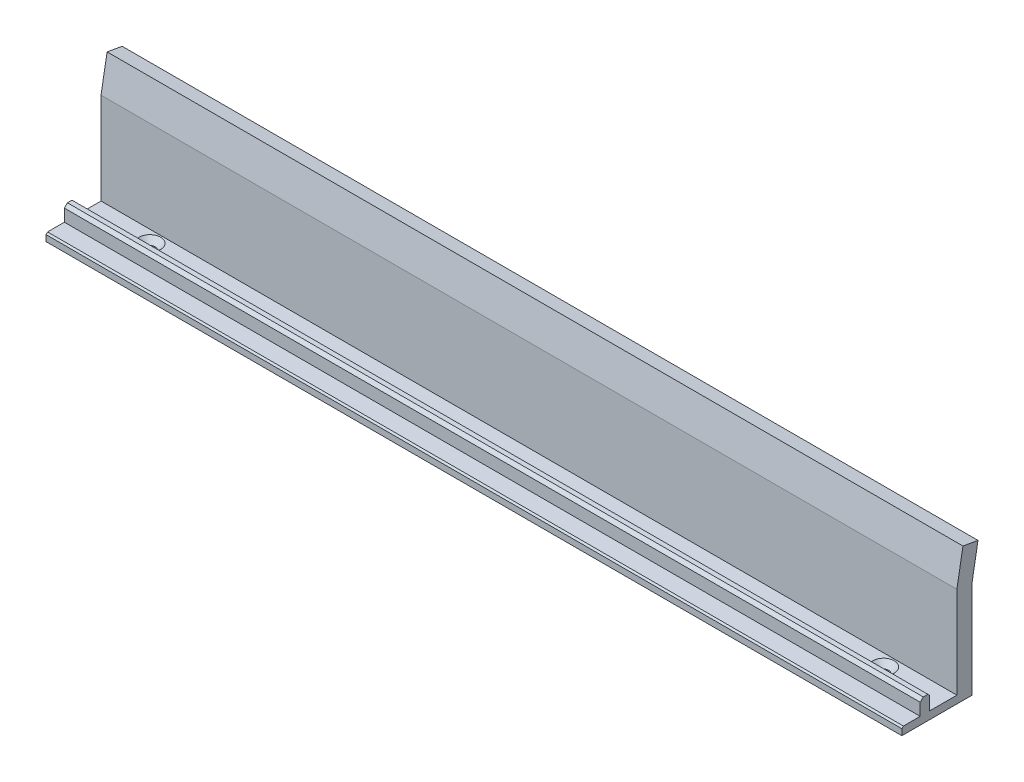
ISO-10303-21;
HEADER;
FILE_DESCRIPTION(('STEP AP214'),'2;1');
FILE_NAME('part.step','',(''),(''),'','','');
FILE_SCHEMA(('AUTOMOTIVE_DESIGN { 1 0 10303 214 1 1 1 1 }'));
ENDSEC;
DATA;
#1=APPLICATION_CONTEXT('core data for automotive mechanical design processes');
#2=APPLICATION_PROTOCOL_DEFINITION('international standard','automotive_design',2000,#1);
#3=PRODUCT_CONTEXT('',#1,'mechanical');
#4=PRODUCT('Part','Part','',(#3));
#5=PRODUCT_RELATED_PRODUCT_CATEGORY('part','',(#4));
#6=PRODUCT_DEFINITION_FORMATION('','',#4);
#7=PRODUCT_DEFINITION_CONTEXT('part definition',#1,'design');
#8=PRODUCT_DEFINITION('design','',#6,#7);
#9=PRODUCT_DEFINITION_SHAPE('','',#8);
#10=(LENGTH_UNIT() NAMED_UNIT(*) SI_UNIT(.MILLI.,.METRE.));
#11=(NAMED_UNIT(*) PLANE_ANGLE_UNIT() SI_UNIT($,.RADIAN.));
#12=(NAMED_UNIT(*) SI_UNIT($,.STERADIAN.) SOLID_ANGLE_UNIT());
#13=UNCERTAINTY_MEASURE_WITH_UNIT(LENGTH_MEASURE(1.E-05),#10,'distance_accuracy_value','');
#14=(GEOMETRIC_REPRESENTATION_CONTEXT(3) GLOBAL_UNCERTAINTY_ASSIGNED_CONTEXT((#13)) GLOBAL_UNIT_ASSIGNED_CONTEXT((#10,
#11,#12)) REPRESENTATION_CONTEXT('',''));
#15=CARTESIAN_POINT('',(0.,0.,0.));
#16=DIRECTION('',(0.,0.,1.));
#17=DIRECTION('',(1.,0.,0.));
#18=AXIS2_PLACEMENT_3D('',#15,#16,#17);
#19=CARTESIAN_POINT('',(0.,3.,0.));
#20=DIRECTION('',(0.,-1.,0.));
#21=DIRECTION('',(0.,0.,-1.));
#22=AXIS2_PLACEMENT_3D('',#19,#20,#21);
#23=PLANE('',#22);
#24=CARTESIAN_POINT('',(120.,3.,-2.5));
#25=DIRECTION('',(0.,1.,0.));
#26=DIRECTION('',(0.,0.,1.));
#27=AXIS2_PLACEMENT_3D('',#24,#25,#26);
#28=CIRCLE('',#27,3.5);
#29=CARTESIAN_POINT('',(120.,3.,1.));
#30=VERTEX_POINT('',#29);
#31=EDGE_CURVE('E222',#30,#30,#28,.T.);
#32=ORIENTED_EDGE('',*,*,#31,.F.);
#33=EDGE_LOOP('',(#32));
#34=FACE_BOUND('',#33,.T.);
#35=CARTESIAN_POINT('',(-120.,3.,-2.5));
#36=DIRECTION('',(0.,1.,0.));
#37=DIRECTION('',(0.,0.,1.));
#38=AXIS2_PLACEMENT_3D('',#35,#36,#37);
#39=CIRCLE('',#38,3.5);
#40=CARTESIAN_POINT('',(-120.,3.,1.));
#41=VERTEX_POINT('',#40);
#42=EDGE_CURVE('E234',#41,#41,#39,.T.);
#43=ORIENTED_EDGE('',*,*,#42,.F.);
#44=EDGE_LOOP('',(#43));
#45=FACE_BOUND('',#44,.T.);
#46=DIRECTION('',(0.,0.,-1.));
#47=VECTOR('',#46,1.);
#48=CARTESIAN_POINT('',(140.,3.,11.5));
#49=LINE('',#48,#47);
#50=CARTESIAN_POINT('',(140.,3.,2.5));
#51=VERTEX_POINT('',#50);
#52=CARTESIAN_POINT('',(140.,3.,-6.5));
#53=VERTEX_POINT('',#52);
#54=EDGE_CURVE('E57',#51,#53,#49,.T.);
#55=ORIENTED_EDGE('',*,*,#54,.T.);
#56=DIRECTION('',(1.,0.,0.));
#57=VECTOR('',#56,1.);
#58=CARTESIAN_POINT('',(-181.838276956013,3.,-6.5));
#59=LINE('',#58,#57);
#60=CARTESIAN_POINT('',(-140.,3.,-6.5));
#61=VERTEX_POINT('',#60);
#62=EDGE_CURVE('E210',#61,#53,#59,.T.);
#63=ORIENTED_EDGE('',*,*,#62,.F.);
#64=DIRECTION('',(0.,0.,1.));
#65=VECTOR('',#64,1.);
#66=CARTESIAN_POINT('',(-140.,3.,11.5));
#67=LINE('',#66,#65);
#68=CARTESIAN_POINT('',(-140.,3.,2.5));
#69=VERTEX_POINT('',#68);
#70=EDGE_CURVE('E281',#61,#69,#67,.T.);
#71=ORIENTED_EDGE('',*,*,#70,.T.);
#72=DIRECTION('',(-1.,0.,0.));
#73=VECTOR('',#72,1.);
#74=CARTESIAN_POINT('',(-140.,3.,2.5));
#75=LINE('',#74,#73);
#76=EDGE_CURVE('E252',#51,#69,#75,.T.);
#77=ORIENTED_EDGE('',*,*,#76,.F.);
#78=EDGE_LOOP('',(#55,#63,#71,#77));
#79=FACE_BOUND('',#78,.T.);
#80=ADVANCED_FACE('F40',(#34,#45,#79),#23,.F.);
#81=CARTESIAN_POINT('',(-140.,3.,5.5));
#82=VERTEX_POINT('',#81);
#83=CARTESIAN_POINT('',(-140.,3.,11.));
#84=VERTEX_POINT('',#83);
#85=EDGE_CURVE('E280',#82,#84,#67,.T.);
#86=ORIENTED_EDGE('',*,*,#85,.T.);
#87=DIRECTION('',(1.,0.,0.));
#88=VECTOR('',#87,1.);
#89=CARTESIAN_POINT('',(0.,3.,11.));
#90=LINE('',#89,#88);
#91=CARTESIAN_POINT('',(140.,3.,11.));
#92=VERTEX_POINT('',#91);
#93=EDGE_CURVE('E332',#84,#92,#90,.T.);
#94=ORIENTED_EDGE('',*,*,#93,.T.);
#95=CARTESIAN_POINT('',(140.,3.,5.5));
#96=VERTEX_POINT('',#95);
#97=EDGE_CURVE('E276',#92,#96,#49,.T.);
#98=ORIENTED_EDGE('',*,*,#97,.T.);
#99=DIRECTION('',(1.,0.,0.));
#100=VECTOR('',#99,1.);
#101=CARTESIAN_POINT('',(-140.,3.,5.5));
#102=LINE('',#101,#100);
#103=EDGE_CURVE('E256',#82,#96,#102,.T.);
#104=ORIENTED_EDGE('',*,*,#103,.F.);
#105=EDGE_LOOP('',(#86,#94,#98,#104));
#106=FACE_BOUND('',#105,.T.);
#107=ADVANCED_FACE('F464',(#106),#23,.F.);
#108=CARTESIAN_POINT('',(140.,3.,11.5));
#109=DIRECTION('',(-1.,0.,0.));
#110=DIRECTION('',(0.,0.,1.));
#111=AXIS2_PLACEMENT_3D('',#108,#109,#110);
#112=PLANE('',#111);
#113=DIRECTION('',(0.,0.,-1.));
#114=VECTOR('',#113,1.);
#115=CARTESIAN_POINT('',(140.,8.,2.5));
#116=LINE('',#115,#114);
#117=CARTESIAN_POINT('',(140.,8.,4.5));
#118=VERTEX_POINT('',#117);
#119=CARTESIAN_POINT('',(140.,8.,3.00000000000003));
#120=VERTEX_POINT('',#119);
#121=EDGE_CURVE('E251',#118,#120,#116,.T.);
#122=ORIENTED_EDGE('',*,*,#121,.F.);
#123=DIRECTION('',(0.,-0.707106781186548,0.707106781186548));
#124=VECTOR('',#123,1.);
#125=CARTESIAN_POINT('',(140.,8.,4.5));
#126=LINE('',#125,#124);
#127=CARTESIAN_POINT('',(140.,7.,5.5));
#128=VERTEX_POINT('',#127);
#129=EDGE_CURVE('E359',#118,#128,#126,.T.);
#130=ORIENTED_EDGE('',*,*,#129,.T.);
#131=DIRECTION('',(0.,-1.,0.));
#132=VECTOR('',#131,1.);
#133=CARTESIAN_POINT('',(140.,8.,5.5));
#134=LINE('',#133,#132);
#135=EDGE_CURVE('E270',#128,#96,#134,.T.);
#136=ORIENTED_EDGE('',*,*,#135,.T.);
#137=ORIENTED_EDGE('',*,*,#97,.F.);
#138=DIRECTION('',(0.,0.707106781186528,-0.707106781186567));
#139=VECTOR('',#138,1.);
#140=CARTESIAN_POINT('',(140.,3.,11.));
#141=LINE('',#140,#139);
#142=CARTESIAN_POINT('',(140.,2.5,11.5));
#143=VERTEX_POINT('',#142);
#144=EDGE_CURVE('E327',#92,#143,#141,.F.);
#145=ORIENTED_EDGE('',*,*,#144,.T.);
#146=DIRECTION('',(0.,-1.,0.));
#147=VECTOR('',#146,1.);
#148=CARTESIAN_POINT('',(140.,3.,11.5));
#149=LINE('',#148,#147);
#150=CARTESIAN_POINT('',(140.,0.500000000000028,11.5));
#151=VERTEX_POINT('',#150);
#152=EDGE_CURVE('E284',#143,#151,#149,.T.);
#153=ORIENTED_EDGE('',*,*,#152,.T.);
#154=DIRECTION('',(0.,0.,-1.));
#155=VECTOR('',#154,1.);
#156=CARTESIAN_POINT('',(140.,0.500000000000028,-11.5));
#157=LINE('',#156,#155);
#158=CARTESIAN_POINT('',(140.,0.500000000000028,-11.5));
#159=VERTEX_POINT('',#158);
#160=EDGE_CURVE('E171',#151,#159,#157,.T.);
#161=ORIENTED_EDGE('',*,*,#160,.T.);
#162=DIRECTION('',(0.,-1.,0.));
#163=VECTOR('',#162,1.);
#164=CARTESIAN_POINT('',(140.,3.,-11.5));
#165=LINE('',#164,#163);
#166=CARTESIAN_POINT('',(140.,32.5625566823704,-11.5));
#167=VERTEX_POINT('',#166);
#168=EDGE_CURVE('E162',#167,#159,#165,.T.);
#169=ORIENTED_EDGE('',*,*,#168,.F.);
#170=DIRECTION('',(0.,0.984807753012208,-0.173648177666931));
#171=VECTOR('',#170,1.);
#172=CARTESIAN_POINT('',(140.,32.5625566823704,-11.5));
#173=LINE('',#172,#171);
#174=CARTESIAN_POINT('',(140.,43.3954419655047,-13.4101299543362));
#175=VERTEX_POINT('',#174);
#176=EDGE_CURVE('E168',#167,#175,#173,.T.);
#177=ORIENTED_EDGE('',*,*,#176,.T.);
#178=DIRECTION('',(0.,0.173648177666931,0.984807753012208));
#179=VECTOR('',#178,1.);
#180=CARTESIAN_POINT('',(140.,43.3954419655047,-13.4101299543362));
#181=LINE('',#180,#179);
#182=CARTESIAN_POINT('',(140.,44.2636828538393,-8.4860911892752));
#183=VERTEX_POINT('',#182);
#184=EDGE_CURVE('E194',#175,#183,#181,.T.);
#185=ORIENTED_EDGE('',*,*,#184,.T.);
#186=DIRECTION('',(0.,-0.984807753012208,0.173648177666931));
#187=VECTOR('',#186,1.);
#188=CARTESIAN_POINT('',(140.,44.2636828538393,-8.4860911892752));
#189=LINE('',#188,#187);
#190=CARTESIAN_POINT('',(140.,33.,-6.5));
#191=VERTEX_POINT('',#190);
#192=EDGE_CURVE('E198',#183,#191,#189,.T.);
#193=ORIENTED_EDGE('',*,*,#192,.T.);
#194=DIRECTION('',(0.,-1.,0.));
#195=VECTOR('',#194,1.);
#196=CARTESIAN_POINT('',(140.,33.,-6.5));
#197=LINE('',#196,#195);
#198=EDGE_CURVE('E188',#191,#53,#197,.T.);
#199=ORIENTED_EDGE('',*,*,#198,.T.);
#200=ORIENTED_EDGE('',*,*,#54,.F.);
#201=DIRECTION('',(0.,-1.,0.));
#202=VECTOR('',#201,1.);
#203=CARTESIAN_POINT('',(140.,8.,2.5));
#204=LINE('',#203,#202);
#205=CARTESIAN_POINT('',(140.,7.5,2.5));
#206=VERTEX_POINT('',#205);
#207=EDGE_CURVE('E267',#206,#51,#204,.T.);
#208=ORIENTED_EDGE('',*,*,#207,.F.);
#209=DIRECTION('',(0.,0.707106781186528,0.707106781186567));
#210=VECTOR('',#209,1.);
#211=CARTESIAN_POINT('',(140.,8.,3.00000000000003));
#212=LINE('',#211,#210);
#213=EDGE_CURVE('E323',#206,#120,#212,.T.);
#214=ORIENTED_EDGE('',*,*,#213,.T.);
#215=EDGE_LOOP('',(#122,#130,#136,#137,#145,#153,#161,#169,#177,#185,#193,#199,#200,#208,#214));
#216=FACE_BOUND('',#215,.T.);
#217=ADVANCED_FACE('F165',(#216),#112,.F.);
#218=CARTESIAN_POINT('',(-140.,3.,-11.5));
#219=DIRECTION('',(0.,0.,1.));
#220=DIRECTION('',(1.,0.,0.));
#221=AXIS2_PLACEMENT_3D('',#218,#219,#220);
#222=PLANE('',#221);
#223=ORIENTED_EDGE('',*,*,#168,.T.);
#224=DIRECTION('',(-1.,0.,0.));
#225=VECTOR('',#224,1.);
#226=CARTESIAN_POINT('',(-140.,0.500000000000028,-11.5));
#227=LINE('',#226,#225);
#228=CARTESIAN_POINT('',(-140.,0.500000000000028,-11.5));
#229=VERTEX_POINT('',#228);
#230=EDGE_CURVE('E176',#159,#229,#227,.T.);
#231=ORIENTED_EDGE('',*,*,#230,.T.);
#232=DIRECTION('',(0.,-1.,0.));
#233=VECTOR('',#232,1.);
#234=CARTESIAN_POINT('',(-140.,3.,-11.5));
#235=LINE('',#234,#233);
#236=CARTESIAN_POINT('',(-140.,32.5625566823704,-11.5));
#237=VERTEX_POINT('',#236);
#238=EDGE_CURVE('E177',#237,#229,#235,.T.);
#239=ORIENTED_EDGE('',*,*,#238,.F.);
#240=DIRECTION('',(1.,0.,0.));
#241=VECTOR('',#240,1.);
#242=CARTESIAN_POINT('',(-181.838276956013,32.5625566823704,-11.5));
#243=LINE('',#242,#241);
#244=EDGE_CURVE('E180',#237,#167,#243,.T.);
#245=ORIENTED_EDGE('',*,*,#244,.T.);
#246=EDGE_LOOP('',(#223,#231,#239,#245));
#247=FACE_BOUND('',#246,.T.);
#248=ADVANCED_FACE('F181',(#247),#222,.F.);
#249=CARTESIAN_POINT('',(-140.,3.,11.5));
#250=DIRECTION('',(1.,0.,0.));
#251=DIRECTION('',(0.,0.,-1.));
#252=AXIS2_PLACEMENT_3D('',#249,#250,#251);
#253=PLANE('',#252);
#254=DIRECTION('',(0.,-1.,0.));
#255=VECTOR('',#254,1.);
#256=CARTESIAN_POINT('',(-140.,8.,5.5));
#257=LINE('',#256,#255);
#258=CARTESIAN_POINT('',(-140.,7.,5.5));
#259=VERTEX_POINT('',#258);
#260=EDGE_CURVE('E273',#259,#82,#257,.T.);
#261=ORIENTED_EDGE('',*,*,#260,.F.);
#262=DIRECTION('',(0.,0.707106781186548,-0.707106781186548));
#263=VECTOR('',#262,1.);
#264=CARTESIAN_POINT('',(-140.,8.,4.5));
#265=LINE('',#264,#263);
#266=CARTESIAN_POINT('',(-140.,8.,4.5));
#267=VERTEX_POINT('',#266);
#268=EDGE_CURVE('E11',#259,#267,#265,.T.);
#269=ORIENTED_EDGE('',*,*,#268,.T.);
#270=DIRECTION('',(0.,0.,1.));
#271=VECTOR('',#270,1.);
#272=CARTESIAN_POINT('',(-140.,8.,2.5));
#273=LINE('',#272,#271);
#274=CARTESIAN_POINT('',(-140.,8.,3.00000000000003));
#275=VERTEX_POINT('',#274);
#276=EDGE_CURVE('E247',#275,#267,#273,.T.);
#277=ORIENTED_EDGE('',*,*,#276,.F.);
#278=DIRECTION('',(0.,-0.707106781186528,-0.707106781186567));
#279=VECTOR('',#278,1.);
#280=CARTESIAN_POINT('',(-140.,8.,3.00000000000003));
#281=LINE('',#280,#279);
#282=CARTESIAN_POINT('',(-140.,7.5,2.5));
#283=VERTEX_POINT('',#282);
#284=EDGE_CURVE('E308',#275,#283,#281,.T.);
#285=ORIENTED_EDGE('',*,*,#284,.T.);
#286=DIRECTION('',(0.,-1.,0.));
#287=VECTOR('',#286,1.);
#288=CARTESIAN_POINT('',(-140.,8.,2.5));
#289=LINE('',#288,#287);
#290=EDGE_CURVE('E255',#283,#69,#289,.T.);
#291=ORIENTED_EDGE('',*,*,#290,.T.);
#292=ORIENTED_EDGE('',*,*,#70,.F.);
#293=DIRECTION('',(0.,1.,0.));
#294=VECTOR('',#293,1.);
#295=CARTESIAN_POINT('',(-140.,33.,-6.5));
#296=LINE('',#295,#294);
#297=CARTESIAN_POINT('',(-140.,33.,-6.5));
#298=VERTEX_POINT('',#297);
#299=EDGE_CURVE('E201',#61,#298,#296,.T.);
#300=ORIENTED_EDGE('',*,*,#299,.T.);
#301=DIRECTION('',(0.,0.984807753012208,-0.173648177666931));
#302=VECTOR('',#301,1.);
#303=CARTESIAN_POINT('',(-140.,44.2636828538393,-8.4860911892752));
#304=LINE('',#303,#302);
#305=CARTESIAN_POINT('',(-140.,44.2636828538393,-8.4860911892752));
#306=VERTEX_POINT('',#305);
#307=EDGE_CURVE('E414',#298,#306,#304,.T.);
#308=ORIENTED_EDGE('',*,*,#307,.T.);
#309=DIRECTION('',(0.,-0.173648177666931,-0.984807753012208));
#310=VECTOR('',#309,1.);
#311=CARTESIAN_POINT('',(-140.,43.3954419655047,-13.4101299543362));
#312=LINE('',#311,#310);
#313=CARTESIAN_POINT('',(-140.,43.3954419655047,-13.4101299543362));
#314=VERTEX_POINT('',#313);
#315=EDGE_CURVE('E417',#306,#314,#312,.T.);
#316=ORIENTED_EDGE('',*,*,#315,.T.);
#317=DIRECTION('',(0.,-0.984807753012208,0.173648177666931));
#318=VECTOR('',#317,1.);
#319=CARTESIAN_POINT('',(-140.,32.5625566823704,-11.5));
#320=LINE('',#319,#318);
#321=EDGE_CURVE('E213',#314,#237,#320,.T.);
#322=ORIENTED_EDGE('',*,*,#321,.T.);
#323=ORIENTED_EDGE('',*,*,#238,.T.);
#324=DIRECTION('',(0.,0.,1.));
#325=VECTOR('',#324,1.);
#326=CARTESIAN_POINT('',(-140.,0.500000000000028,11.5));
#327=LINE('',#326,#325);
#328=CARTESIAN_POINT('',(-140.,0.500000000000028,11.5));
#329=VERTEX_POINT('',#328);
#330=EDGE_CURVE('E314',#229,#329,#327,.T.);
#331=ORIENTED_EDGE('',*,*,#330,.T.);
#332=DIRECTION('',(0.,-1.,0.));
#333=VECTOR('',#332,1.);
#334=CARTESIAN_POINT('',(-140.,3.,11.5));
#335=LINE('',#334,#333);
#336=CARTESIAN_POINT('',(-140.,2.5,11.5));
#337=VERTEX_POINT('',#336);
#338=EDGE_CURVE('E287',#337,#329,#335,.T.);
#339=ORIENTED_EDGE('',*,*,#338,.F.);
#340=DIRECTION('',(0.,-0.707106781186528,0.707106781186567));
#341=VECTOR('',#340,1.);
#342=CARTESIAN_POINT('',(-140.,3.,11.));
#343=LINE('',#342,#341);
#344=EDGE_CURVE('E311',#337,#84,#343,.F.);
#345=ORIENTED_EDGE('',*,*,#344,.T.);
#346=ORIENTED_EDGE('',*,*,#85,.F.);
#347=EDGE_LOOP('',(#261,#269,#277,#285,#291,#292,#300,#308,#316,#322,#323,#331,#339,#345,#346));
#348=FACE_BOUND('',#347,.T.);
#349=ADVANCED_FACE('F432',(#348),#253,.F.);
#350=CARTESIAN_POINT('',(-140.,3.,11.5));
#351=DIRECTION('',(0.,0.,-1.));
#352=DIRECTION('',(-1.,0.,0.));
#353=AXIS2_PLACEMENT_3D('',#350,#351,#352);
#354=PLANE('',#353);
#355=ORIENTED_EDGE('',*,*,#338,.T.);
#356=DIRECTION('',(1.,0.,0.));
#357=VECTOR('',#356,1.);
#358=CARTESIAN_POINT('',(140.,0.500000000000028,11.5));
#359=LINE('',#358,#357);
#360=EDGE_CURVE('E320',#329,#151,#359,.T.);
#361=ORIENTED_EDGE('',*,*,#360,.T.);
#362=ORIENTED_EDGE('',*,*,#152,.F.);
#363=DIRECTION('',(-1.,0.,0.));
#364=VECTOR('',#363,1.);
#365=CARTESIAN_POINT('',(-140.,2.5,11.5));
#366=LINE('',#365,#364);
#367=EDGE_CURVE('E317',#143,#337,#366,.T.);
#368=ORIENTED_EDGE('',*,*,#367,.T.);
#369=EDGE_LOOP('',(#355,#361,#362,#368));
#370=FACE_BOUND('',#369,.T.);
#371=ADVANCED_FACE('F474',(#370),#354,.F.);
#372=CARTESIAN_POINT('',(0.,0.,0.));
#373=DIRECTION('',(0.,-1.,0.));
#374=DIRECTION('',(0.,0.,-1.));
#375=AXIS2_PLACEMENT_3D('',#372,#373,#374);
#376=PLANE('',#375);
#377=CARTESIAN_POINT('',(120.,0.,-2.5));
#378=DIRECTION('',(0.,1.,0.));
#379=DIRECTION('',(0.,0.,1.));
#380=AXIS2_PLACEMENT_3D('',#377,#378,#379);
#381=CIRCLE('',#380,1.69999999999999);
#382=CARTESIAN_POINT('',(120.,0.,-0.800000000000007));
#383=VERTEX_POINT('',#382);
#384=EDGE_CURVE('E230',#383,#383,#381,.T.);
#385=ORIENTED_EDGE('',*,*,#384,.T.);
#386=EDGE_LOOP('',(#385));
#387=FACE_BOUND('',#386,.T.);
#388=CARTESIAN_POINT('',(-120.,0.,-2.5));
#389=DIRECTION('',(0.,1.,0.));
#390=DIRECTION('',(0.,0.,1.));
#391=AXIS2_PLACEMENT_3D('',#388,#389,#390);
#392=CIRCLE('',#391,1.69999999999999);
#393=CARTESIAN_POINT('',(-120.,0.,-0.800000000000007));
#394=VERTEX_POINT('',#393);
#395=EDGE_CURVE('E242',#394,#394,#392,.T.);
#396=ORIENTED_EDGE('',*,*,#395,.T.);
#397=EDGE_LOOP('',(#396));
#398=FACE_BOUND('',#397,.T.);
#399=DIRECTION('',(0.,0.,-1.));
#400=VECTOR('',#399,1.);
#401=CARTESIAN_POINT('',(-139.5,0.,-11.5));
#402=LINE('',#401,#400);
#403=CARTESIAN_POINT('',(-139.5,0.,11.));
#404=VERTEX_POINT('',#403);
#405=CARTESIAN_POINT('',(-139.5,0.,-11.));
#406=VERTEX_POINT('',#405);
#407=EDGE_CURVE('E301',#404,#406,#402,.T.);
#408=ORIENTED_EDGE('',*,*,#407,.T.);
#409=DIRECTION('',(1.,0.,0.));
#410=VECTOR('',#409,1.);
#411=CARTESIAN_POINT('',(140.,0.,-11.));
#412=LINE('',#411,#410);
#413=CARTESIAN_POINT('',(139.5,0.,-11.));
#414=VERTEX_POINT('',#413);
#415=EDGE_CURVE('E304',#406,#414,#412,.T.);
#416=ORIENTED_EDGE('',*,*,#415,.T.);
#417=DIRECTION('',(0.,0.,1.));
#418=VECTOR('',#417,1.);
#419=CARTESIAN_POINT('',(139.5,0.,11.5));
#420=LINE('',#419,#418);
#421=CARTESIAN_POINT('',(139.5,0.,11.));
#422=VERTEX_POINT('',#421);
#423=EDGE_CURVE('E295',#414,#422,#420,.T.);
#424=ORIENTED_EDGE('',*,*,#423,.T.);
#425=DIRECTION('',(-1.,0.,0.));
#426=VECTOR('',#425,1.);
#427=CARTESIAN_POINT('',(-140.,0.,11.));
#428=LINE('',#427,#426);
#429=EDGE_CURVE('E298',#422,#404,#428,.T.);
#430=ORIENTED_EDGE('',*,*,#429,.T.);
#431=EDGE_LOOP('',(#408,#416,#424,#430));
#432=FACE_BOUND('',#431,.T.);
#433=ADVANCED_FACE('F487',(#387,#398,#432),#376,.T.);
#434=CARTESIAN_POINT('',(-140.,8.,5.5));
#435=DIRECTION('',(0.,0.,-1.));
#436=DIRECTION('',(-1.,0.,0.));
#437=AXIS2_PLACEMENT_3D('',#434,#435,#436);
#438=PLANE('',#437);
#439=ORIENTED_EDGE('',*,*,#135,.F.);
#440=DIRECTION('',(-1.,0.,0.));
#441=VECTOR('',#440,1.);
#442=CARTESIAN_POINT('',(-140.,7.,5.5));
#443=LINE('',#442,#441);
#444=EDGE_CURVE('E50',#128,#259,#443,.T.);
#445=ORIENTED_EDGE('',*,*,#444,.T.);
#446=ORIENTED_EDGE('',*,*,#260,.T.);
#447=ORIENTED_EDGE('',*,*,#103,.T.);
#448=EDGE_LOOP('',(#439,#445,#446,#447));
#449=FACE_BOUND('',#448,.T.);
#450=ADVANCED_FACE('F461',(#449),#438,.F.);
#451=CARTESIAN_POINT('',(-140.,8.,2.5));
#452=DIRECTION('',(0.,0.,1.));
#453=DIRECTION('',(1.,0.,0.));
#454=AXIS2_PLACEMENT_3D('',#451,#452,#453);
#455=PLANE('',#454);
#456=ORIENTED_EDGE('',*,*,#290,.F.);
#457=DIRECTION('',(1.,0.,0.));
#458=VECTOR('',#457,1.);
#459=CARTESIAN_POINT('',(140.,7.5,2.5));
#460=LINE('',#459,#458);
#461=EDGE_CURVE('E340',#283,#206,#460,.T.);
#462=ORIENTED_EDGE('',*,*,#461,.T.);
#463=ORIENTED_EDGE('',*,*,#207,.T.);
#464=ORIENTED_EDGE('',*,*,#76,.T.);
#465=EDGE_LOOP('',(#456,#462,#463,#464));
#466=FACE_BOUND('',#465,.T.);
#467=ADVANCED_FACE('F448',(#466),#455,.F.);
#468=CARTESIAN_POINT('',(0.,8.,0.));
#469=DIRECTION('',(0.,1.,0.));
#470=DIRECTION('',(0.,0.,1.));
#471=AXIS2_PLACEMENT_3D('',#468,#469,#470);
#472=PLANE('',#471);
#473=ORIENTED_EDGE('',*,*,#276,.T.);
#474=DIRECTION('',(1.,0.,0.));
#475=VECTOR('',#474,1.);
#476=CARTESIAN_POINT('',(140.,8.,4.5));
#477=LINE('',#476,#475);
#478=EDGE_CURVE('E343',#267,#118,#477,.T.);
#479=ORIENTED_EDGE('',*,*,#478,.T.);
#480=ORIENTED_EDGE('',*,*,#121,.T.);
#481=DIRECTION('',(-1.,0.,0.));
#482=VECTOR('',#481,1.);
#483=CARTESIAN_POINT('',(-140.,8.,3.00000000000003));
#484=LINE('',#483,#482);
#485=EDGE_CURVE('E336',#120,#275,#484,.T.);
#486=ORIENTED_EDGE('',*,*,#485,.T.);
#487=EDGE_LOOP('',(#473,#479,#480,#486));
#488=FACE_BOUND('',#487,.T.);
#489=ADVANCED_FACE('F455',(#488),#472,.T.);
#490=CARTESIAN_POINT('',(-140.,0.500000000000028,11.5));
#491=DIRECTION('',(0.,-0.707106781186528,0.707106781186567));
#492=DIRECTION('',(-1.,0.,0.));
#493=AXIS2_PLACEMENT_3D('',#490,#491,#492);
#494=PLANE('',#493);
#495=DIRECTION('',(0.577350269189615,-0.577350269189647,-0.577350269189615));
#496=VECTOR('',#495,1.);
#497=CARTESIAN_POINT('',(-140.,0.500000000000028,11.5));
#498=LINE('',#497,#496);
#499=EDGE_CURVE('E349',#404,#329,#498,.F.);
#500=ORIENTED_EDGE('',*,*,#499,.F.);
#501=ORIENTED_EDGE('',*,*,#429,.F.);
#502=DIRECTION('',(-0.577350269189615,-0.577350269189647,-0.577350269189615));
#503=VECTOR('',#502,1.);
#504=CARTESIAN_POINT('',(140.,0.500000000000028,11.5));
#505=LINE('',#504,#503);
#506=EDGE_CURVE('E260',#151,#422,#505,.T.);
#507=ORIENTED_EDGE('',*,*,#506,.F.);
#508=ORIENTED_EDGE('',*,*,#360,.F.);
#509=EDGE_LOOP('',(#500,#501,#507,#508));
#510=FACE_BOUND('',#509,.T.);
#511=ADVANCED_FACE('F478',(#510),#494,.T.);
#512=CARTESIAN_POINT('',(140.,0.500000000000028,11.5));
#513=DIRECTION('',(0.707106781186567,-0.707106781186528,0.));
#514=DIRECTION('',(0.,0.,1.));
#515=AXIS2_PLACEMENT_3D('',#512,#513,#514);
#516=PLANE('',#515);
#517=ORIENTED_EDGE('',*,*,#506,.T.);
#518=ORIENTED_EDGE('',*,*,#423,.F.);
#519=DIRECTION('',(0.577350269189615,0.577350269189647,-0.577350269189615));
#520=VECTOR('',#519,1.);
#521=CARTESIAN_POINT('',(132.333333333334,-7.16666666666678,-3.83333333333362));
#522=LINE('',#521,#520);
#523=EDGE_CURVE('E346',#159,#414,#522,.F.);
#524=ORIENTED_EDGE('',*,*,#523,.F.);
#525=ORIENTED_EDGE('',*,*,#160,.F.);
#526=EDGE_LOOP('',(#517,#518,#524,#525));
#527=FACE_BOUND('',#526,.T.);
#528=ADVANCED_FACE('F493',(#527),#516,.T.);
#529=CARTESIAN_POINT('',(-140.,0.500000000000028,11.5));
#530=DIRECTION('',(-0.707106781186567,-0.707106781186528,0.));
#531=DIRECTION('',(0.,0.,-1.));
#532=AXIS2_PLACEMENT_3D('',#529,#530,#531);
#533=PLANE('',#532);
#534=ORIENTED_EDGE('',*,*,#499,.T.);
#535=ORIENTED_EDGE('',*,*,#330,.F.);
#536=DIRECTION('',(0.577350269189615,-0.577350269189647,0.577350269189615));
#537=VECTOR('',#536,1.);
#538=CARTESIAN_POINT('',(-132.333333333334,-7.16666666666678,-3.83333333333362));
#539=LINE('',#538,#537);
#540=EDGE_CURVE('E246',#406,#229,#539,.F.);
#541=ORIENTED_EDGE('',*,*,#540,.F.);
#542=ORIENTED_EDGE('',*,*,#407,.F.);
#543=EDGE_LOOP('',(#534,#535,#541,#542));
#544=FACE_BOUND('',#543,.T.);
#545=ADVANCED_FACE('F483',(#544),#533,.T.);
#546=CARTESIAN_POINT('',(-140.,0.500000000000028,-11.5));
#547=DIRECTION('',(0.,-0.707106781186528,-0.707106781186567));
#548=DIRECTION('',(1.,0.,0.));
#549=AXIS2_PLACEMENT_3D('',#546,#547,#548);
#550=PLANE('',#549);
#551=ORIENTED_EDGE('',*,*,#523,.T.);
#552=ORIENTED_EDGE('',*,*,#415,.F.);
#553=ORIENTED_EDGE('',*,*,#540,.T.);
#554=ORIENTED_EDGE('',*,*,#230,.F.);
#555=EDGE_LOOP('',(#551,#552,#553,#554));
#556=FACE_BOUND('',#555,.T.);
#557=ADVANCED_FACE('F489',(#556),#550,.T.);
#558=CARTESIAN_POINT('',(0.,3.,11.));
#559=DIRECTION('',(0.,-0.707106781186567,-0.707106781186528));
#560=DIRECTION('',(1.,0.,0.));
#561=AXIS2_PLACEMENT_3D('',#558,#559,#560);
#562=PLANE('',#561);
#563=ORIENTED_EDGE('',*,*,#344,.F.);
#564=ORIENTED_EDGE('',*,*,#367,.F.);
#565=ORIENTED_EDGE('',*,*,#144,.F.);
#566=ORIENTED_EDGE('',*,*,#93,.F.);
#567=EDGE_LOOP('',(#563,#564,#565,#566));
#568=FACE_BOUND('',#567,.T.);
#569=ADVANCED_FACE('F470',(#568),#562,.F.);
#570=CARTESIAN_POINT('',(0.,8.,3.00000000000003));
#571=DIRECTION('',(0.,0.707106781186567,-0.707106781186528));
#572=DIRECTION('',(1.,0.,0.));
#573=AXIS2_PLACEMENT_3D('',#570,#571,#572);
#574=PLANE('',#573);
#575=ORIENTED_EDGE('',*,*,#213,.F.);
#576=ORIENTED_EDGE('',*,*,#461,.F.);
#577=ORIENTED_EDGE('',*,*,#284,.F.);
#578=ORIENTED_EDGE('',*,*,#485,.F.);
#579=EDGE_LOOP('',(#575,#576,#577,#578));
#580=FACE_BOUND('',#579,.T.);
#581=ADVANCED_FACE('F453',(#580),#574,.T.);
#582=CARTESIAN_POINT('',(0.,8.,4.5));
#583=DIRECTION('',(0.,0.707106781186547,0.707106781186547));
#584=DIRECTION('',(-1.,0.,0.));
#585=AXIS2_PLACEMENT_3D('',#582,#583,#584);
#586=PLANE('',#585);
#587=ORIENTED_EDGE('',*,*,#268,.F.);
#588=ORIENTED_EDGE('',*,*,#444,.F.);
#589=ORIENTED_EDGE('',*,*,#129,.F.);
#590=ORIENTED_EDGE('',*,*,#478,.F.);
#591=EDGE_LOOP('',(#587,#588,#589,#590));
#592=FACE_BOUND('',#591,.T.);
#593=ADVANCED_FACE('F43',(#592),#586,.T.);
#594=CARTESIAN_POINT('',(-120.,3.,-2.5));
#595=DIRECTION('',(0.,1.,0.));
#596=DIRECTION('',(0.,0.,1.));
#597=AXIS2_PLACEMENT_3D('',#594,#595,#596);
#598=CYLINDRICAL_SURFACE('',#597,1.69999999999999);
#599=ORIENTED_EDGE('',*,*,#395,.F.);
#600=EDGE_LOOP('',(#599));
#601=FACE_BOUND('',#600,.T.);
#602=CARTESIAN_POINT('',(-120.,1.19999999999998,-2.5));
#603=DIRECTION('',(0.,1.,0.));
#604=DIRECTION('',(0.,0.,1.));
#605=AXIS2_PLACEMENT_3D('',#602,#603,#604);
#606=CIRCLE('',#605,1.69999999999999);
#607=CARTESIAN_POINT('',(-120.,1.19999999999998,-0.800000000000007));
#608=VERTEX_POINT('',#607);
#609=EDGE_CURVE('E238',#608,#608,#606,.T.);
#610=ORIENTED_EDGE('',*,*,#609,.T.);
#611=EDGE_LOOP('',(#610));
#612=FACE_BOUND('',#611,.T.);
#613=ADVANCED_FACE('F549',(#601,#612),#598,.F.);
#614=CARTESIAN_POINT('',(-120.,3.,-2.5));
#615=DIRECTION('',(0.,1.,0.));
#616=DIRECTION('',(0.,0.,1.));
#617=AXIS2_PLACEMENT_3D('',#614,#615,#616);
#618=CONICAL_SURFACE('',#617,3.5,0.785398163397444);
#619=ORIENTED_EDGE('',*,*,#609,.F.);
#620=EDGE_LOOP('',(#619));
#621=FACE_BOUND('',#620,.T.);
#622=ORIENTED_EDGE('',*,*,#42,.T.);
#623=EDGE_LOOP('',(#622));
#624=FACE_BOUND('',#623,.T.);
#625=ADVANCED_FACE('F553',(#621,#624),#618,.F.);
#626=CARTESIAN_POINT('',(120.,3.,-2.5));
#627=DIRECTION('',(0.,1.,0.));
#628=DIRECTION('',(0.,0.,1.));
#629=AXIS2_PLACEMENT_3D('',#626,#627,#628);
#630=CYLINDRICAL_SURFACE('',#629,1.69999999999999);
#631=ORIENTED_EDGE('',*,*,#384,.F.);
#632=EDGE_LOOP('',(#631));
#633=FACE_BOUND('',#632,.T.);
#634=CARTESIAN_POINT('',(120.,1.19999999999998,-2.5));
#635=DIRECTION('',(0.,1.,0.));
#636=DIRECTION('',(0.,0.,1.));
#637=AXIS2_PLACEMENT_3D('',#634,#635,#636);
#638=CIRCLE('',#637,1.69999999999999);
#639=CARTESIAN_POINT('',(120.,1.19999999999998,-0.800000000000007));
#640=VERTEX_POINT('',#639);
#641=EDGE_CURVE('E226',#640,#640,#638,.T.);
#642=ORIENTED_EDGE('',*,*,#641,.T.);
#643=EDGE_LOOP('',(#642));
#644=FACE_BOUND('',#643,.T.);
#645=ADVANCED_FACE('F559',(#633,#644),#630,.F.);
#646=CARTESIAN_POINT('',(120.,3.,-2.5));
#647=DIRECTION('',(0.,1.,0.));
#648=DIRECTION('',(0.,0.,1.));
#649=AXIS2_PLACEMENT_3D('',#646,#647,#648);
#650=CONICAL_SURFACE('',#649,3.5,0.785398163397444);
#651=ORIENTED_EDGE('',*,*,#641,.F.);
#652=EDGE_LOOP('',(#651));
#653=FACE_BOUND('',#652,.T.);
#654=ORIENTED_EDGE('',*,*,#31,.T.);
#655=EDGE_LOOP('',(#654));
#656=FACE_BOUND('',#655,.T.);
#657=ADVANCED_FACE('F609',(#653,#656),#650,.F.);
#658=CARTESIAN_POINT('',(-181.838276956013,33.,-6.5));
#659=DIRECTION('',(0.,0.,1.));
#660=DIRECTION('',(0.,-1.,0.));
#661=AXIS2_PLACEMENT_3D('',#658,#659,#660);
#662=PLANE('',#661);
#663=ORIENTED_EDGE('',*,*,#299,.F.);
#664=ORIENTED_EDGE('',*,*,#62,.T.);
#665=ORIENTED_EDGE('',*,*,#198,.F.);
#666=DIRECTION('',(1.,0.,0.));
#667=VECTOR('',#666,1.);
#668=CARTESIAN_POINT('',(-181.838276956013,33.,-6.5));
#669=LINE('',#668,#667);
#670=EDGE_CURVE('E214',#298,#191,#669,.T.);
#671=ORIENTED_EDGE('',*,*,#670,.F.);
#672=EDGE_LOOP('',(#663,#664,#665,#671));
#673=FACE_BOUND('',#672,.T.);
#674=ADVANCED_FACE('F443',(#673),#662,.T.);
#675=CARTESIAN_POINT('',(-181.838276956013,44.2636828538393,-8.4860911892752));
#676=DIRECTION('',(0.,0.173648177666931,0.984807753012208));
#677=DIRECTION('',(0.,-0.984807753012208,0.173648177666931));
#678=AXIS2_PLACEMENT_3D('',#675,#676,#677);
#679=PLANE('',#678);
#680=ORIENTED_EDGE('',*,*,#307,.F.);
#681=ORIENTED_EDGE('',*,*,#670,.T.);
#682=ORIENTED_EDGE('',*,*,#192,.F.);
#683=DIRECTION('',(1.,0.,0.));
#684=VECTOR('',#683,1.);
#685=CARTESIAN_POINT('',(-181.838276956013,44.2636828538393,-8.4860911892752));
#686=LINE('',#685,#684);
#687=EDGE_CURVE('E217',#306,#183,#686,.T.);
#688=ORIENTED_EDGE('',*,*,#687,.F.);
#689=EDGE_LOOP('',(#680,#681,#682,#688));
#690=FACE_BOUND('',#689,.T.);
#691=ADVANCED_FACE('F634',(#690),#679,.T.);
#692=CARTESIAN_POINT('',(-181.838276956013,43.3954419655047,-13.4101299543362));
#693=DIRECTION('',(0.,0.984807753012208,-0.173648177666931));
#694=DIRECTION('',(0.,0.173648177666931,0.984807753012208));
#695=AXIS2_PLACEMENT_3D('',#692,#693,#694);
#696=PLANE('',#695);
#697=ORIENTED_EDGE('',*,*,#315,.F.);
#698=ORIENTED_EDGE('',*,*,#687,.T.);
#699=ORIENTED_EDGE('',*,*,#184,.F.);
#700=DIRECTION('',(1.,0.,0.));
#701=VECTOR('',#700,1.);
#702=CARTESIAN_POINT('',(-181.838276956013,43.3954419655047,-13.4101299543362));
#703=LINE('',#702,#701);
#704=EDGE_CURVE('E187',#314,#175,#703,.T.);
#705=ORIENTED_EDGE('',*,*,#704,.F.);
#706=EDGE_LOOP('',(#697,#698,#699,#705));
#707=FACE_BOUND('',#706,.T.);
#708=ADVANCED_FACE('F435',(#707),#696,.T.);
#709=CARTESIAN_POINT('',(-181.838276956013,32.5625566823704,-11.5));
#710=DIRECTION('',(0.,-0.173648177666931,-0.984807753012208));
#711=DIRECTION('',(0.,0.984807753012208,-0.173648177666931));
#712=AXIS2_PLACEMENT_3D('',#709,#710,#711);
#713=PLANE('',#712);
#714=ORIENTED_EDGE('',*,*,#321,.F.);
#715=ORIENTED_EDGE('',*,*,#704,.T.);
#716=ORIENTED_EDGE('',*,*,#176,.F.);
#717=ORIENTED_EDGE('',*,*,#244,.F.);
#718=EDGE_LOOP('',(#714,#715,#716,#717));
#719=FACE_BOUND('',#718,.T.);
#720=ADVANCED_FACE('F190',(#719),#713,.T.);
#721=CLOSED_SHELL('',(#80,#107,#217,#248,#349,#371,#433,#450,#467,#489,#511,#528,#545,#557,#569,
#581,#593,#613,#625,#645,#657,#674,#691,#708,#720));
#722=MANIFOLD_SOLID_BREP('B2',#721);
#723=ADVANCED_BREP_SHAPE_REPRESENTATION('',(#18,#722),#14);
#724=SHAPE_DEFINITION_REPRESENTATION(#9,#723);
ENDSEC;
END-ISO-10303-21;
